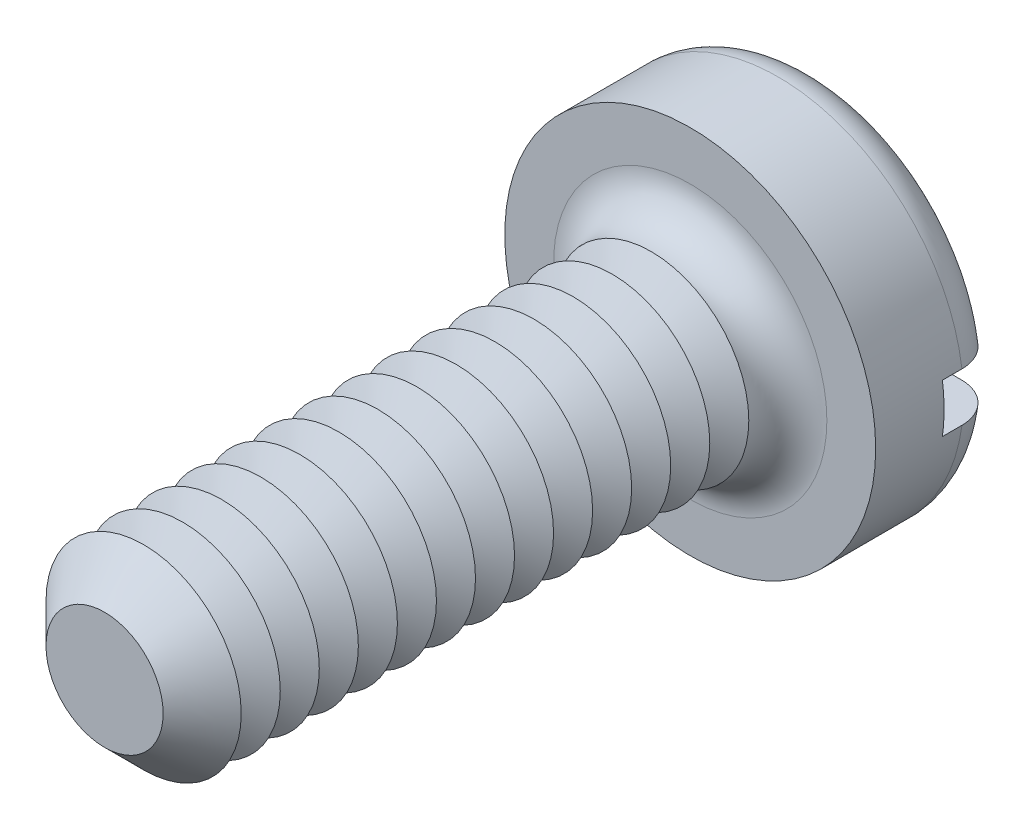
ISO-10303-21;
HEADER;
FILE_DESCRIPTION(('STEP AP214'),'2;1');
FILE_NAME('part.step','',(''),(''),'','','');
FILE_SCHEMA(('AUTOMOTIVE_DESIGN { 1 0 10303 214 1 1 1 1 }'));
ENDSEC;
DATA;
#1=APPLICATION_CONTEXT('core data for automotive mechanical design processes');
#2=APPLICATION_PROTOCOL_DEFINITION('international standard','automotive_design',2000,#1);
#3=PRODUCT_CONTEXT('',#1,'mechanical');
#4=PRODUCT('Part','Part','',(#3));
#5=PRODUCT_RELATED_PRODUCT_CATEGORY('part','',(#4));
#6=PRODUCT_DEFINITION_FORMATION('','',#4);
#7=PRODUCT_DEFINITION_CONTEXT('part definition',#1,'design');
#8=PRODUCT_DEFINITION('design','',#6,#7);
#9=PRODUCT_DEFINITION_SHAPE('','',#8);
#10=(LENGTH_UNIT() NAMED_UNIT(*) SI_UNIT(.MILLI.,.METRE.));
#11=(NAMED_UNIT(*) PLANE_ANGLE_UNIT() SI_UNIT($,.RADIAN.));
#12=(NAMED_UNIT(*) SI_UNIT($,.STERADIAN.) SOLID_ANGLE_UNIT());
#13=UNCERTAINTY_MEASURE_WITH_UNIT(LENGTH_MEASURE(1.E-05),#10,'distance_accuracy_value','');
#14=(GEOMETRIC_REPRESENTATION_CONTEXT(3) GLOBAL_UNCERTAINTY_ASSIGNED_CONTEXT((#13)) GLOBAL_UNIT_ASSIGNED_CONTEXT((#10,
#11,#12)) REPRESENTATION_CONTEXT('',''));
#15=CARTESIAN_POINT('',(0.,0.,0.));
#16=DIRECTION('',(0.,0.,1.));
#17=DIRECTION('',(1.,0.,0.));
#18=AXIS2_PLACEMENT_3D('',#15,#16,#17);
#19=CARTESIAN_POINT('',(0.,0.,-1.3));
#20=DIRECTION('',(0.,0.,1.));
#21=DIRECTION('',(1.,0.,0.));
#22=AXIS2_PLACEMENT_3D('',#19,#20,#21);
#23=PLANE('',#22);
#24=CARTESIAN_POINT('',(0.,0.,-1.3));
#25=DIRECTION('',(0.,0.,1.));
#26=DIRECTION('',(1.,0.,0.));
#27=AXIS2_PLACEMENT_3D('',#24,#25,#26);
#28=CIRCLE('',#27,1.5);
#29=CARTESIAN_POINT('',(-1.4790199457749,0.25,-1.3));
#30=VERTEX_POINT('',#29);
#31=CARTESIAN_POINT('',(1.4790199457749,0.25,-1.3));
#32=VERTEX_POINT('',#31);
#33=EDGE_CURVE('E116',#30,#32,#28,.F.);
#34=ORIENTED_EDGE('',*,*,#33,.T.);
#35=DIRECTION('',(1.,0.,0.));
#36=VECTOR('',#35,1.);
#37=CARTESIAN_POINT('',(-1.9,0.25,-1.3));
#38=LINE('',#37,#36);
#39=EDGE_CURVE('E111',#30,#32,#38,.T.);
#40=ORIENTED_EDGE('',*,*,#39,.F.);
#41=EDGE_LOOP('',(#34,#40));
#42=FACE_BOUND('',#41,.T.);
#43=ADVANCED_FACE('F39',(#42),#23,.F.);
#44=CARTESIAN_POINT('',(0.,0.,-0.9));
#45=DIRECTION('',(0.,0.,1.));
#46=DIRECTION('',(1.,0.,0.));
#47=AXIS2_PLACEMENT_3D('',#44,#45,#46);
#48=TOROIDAL_SURFACE('',#47,1.5,0.4);
#49=CARTESIAN_POINT('',(-1.8150392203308,0.25,-1.12284384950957));
#50=CARTESIAN_POINT('',(-1.80236980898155,0.25,-1.14155059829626));
#51=CARTESIAN_POINT('',(-1.78809920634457,0.25,-1.15919399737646));
#52=CARTESIAN_POINT('',(-1.75677844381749,0.25,-1.19184073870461));
#53=CARTESIAN_POINT('',(-1.73972468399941,0.25,-1.20684060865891));
#54=CARTESIAN_POINT('',(-1.70336024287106,0.25,-1.23375848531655));
#55=CARTESIAN_POINT('',(-1.68405164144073,0.25,-1.24567930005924));
#56=CARTESIAN_POINT('',(-1.64372549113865,0.25,-1.26613528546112));
#57=CARTESIAN_POINT('',(-1.6227083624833,0.25,-1.27467128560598));
#58=CARTESIAN_POINT('',(-1.57937988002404,0.25,-1.2881995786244));
#59=CARTESIAN_POINT('',(-1.55705957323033,0.25,-1.29316318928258));
#60=CARTESIAN_POINT('',(-1.51190394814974,0.25,-1.29931753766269));
#61=CARTESIAN_POINT('',(-1.48906857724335,0.25,-1.3005078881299));
#62=CARTESIAN_POINT('',(-1.4432641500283,0.25,-1.29909058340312));
#63=CARTESIAN_POINT('',(-1.42029638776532,0.25,-1.29644099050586));
#64=CARTESIAN_POINT('',(-1.37512297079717,0.25,-1.28735146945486));
#65=CARTESIAN_POINT('',(-1.3529173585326,0.25,-1.28091133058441));
#66=CARTESIAN_POINT('',(-1.30974098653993,0.25,-1.26436295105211));
#67=CARTESIAN_POINT('',(-1.28877978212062,0.25,-1.25422975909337));
#68=CARTESIAN_POINT('',(-1.24886205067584,0.25,-1.23057736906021));
#69=CARTESIAN_POINT('',(-1.22990554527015,0.25,-1.21705813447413));
#70=CARTESIAN_POINT('',(-1.19461911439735,0.25,-1.18704970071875));
#71=CARTESIAN_POINT('',(-1.17828051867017,0.25,-1.17057070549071));
#72=CARTESIAN_POINT('',(-1.14865897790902,0.25,-1.13506201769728));
#73=CARTESIAN_POINT('',(-1.13537576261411,0.25,-1.11603255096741));
#74=CARTESIAN_POINT('',(-1.11249827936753,0.25,-1.07630328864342));
#75=CARTESIAN_POINT('',(-1.10284494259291,0.25,-1.05563752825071));
#76=CARTESIAN_POINT('',(-1.08724024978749,0.25,-1.01295282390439));
#77=CARTESIAN_POINT('',(-1.08128829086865,0.25,-0.990934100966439));
#78=CARTESIAN_POINT('',(-1.07339124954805,0.25,-0.946722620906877));
#79=CARTESIAN_POINT('',(-1.07135558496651,0.25,-0.924546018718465));
#80=CARTESIAN_POINT('',(-1.07108722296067,0.25,-0.880170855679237));
#81=CARTESIAN_POINT('',(-1.07285419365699,0.25,-0.857972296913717));
#82=CARTESIAN_POINT('',(-1.0800838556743,0.25,-0.814463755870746));
#83=CARTESIAN_POINT('',(-1.08550159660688,0.25,-0.793146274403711));
#84=CARTESIAN_POINT('',(-1.09980522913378,0.25,-0.751709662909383));
#85=CARTESIAN_POINT('',(-1.10869126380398,0.25,-0.731590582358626));
#86=CARTESIAN_POINT('',(-1.12975121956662,0.25,-0.692901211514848));
#87=CARTESIAN_POINT('',(-1.14195627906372,0.25,-0.674347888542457));
#88=CARTESIAN_POINT('',(-1.1692428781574,0.25,-0.639494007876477));
#89=CARTESIAN_POINT('',(-1.18432473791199,0.25,-0.623193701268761));
#90=CARTESIAN_POINT('',(-1.21730350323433,0.25,-0.592916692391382));
#91=CARTESIAN_POINT('',(-1.23525650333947,0.25,-0.579001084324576));
#92=CARTESIAN_POINT('',(-1.27320799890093,0.25,-0.554314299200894));
#93=CARTESIAN_POINT('',(-1.2932067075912,0.25,-0.543543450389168));
#94=CARTESIAN_POINT('',(-1.33509120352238,0.25,-0.525253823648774));
#95=CARTESIAN_POINT('',(-1.35700545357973,0.25,-0.517800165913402));
#96=CARTESIAN_POINT('',(-1.401770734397,0.25,-0.506652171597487));
#97=CARTESIAN_POINT('',(-1.42462180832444,0.25,-0.502958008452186));
#98=CARTESIAN_POINT('',(-1.4707602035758,0.25,-0.499429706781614));
#99=CARTESIAN_POINT('',(-1.49404932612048,0.25,-0.499619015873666));
#100=CARTESIAN_POINT('',(-1.54026206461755,0.25,-0.50392615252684));
#101=CARTESIAN_POINT('',(-1.56318568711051,0.25,-0.508043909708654));
#102=CARTESIAN_POINT('',(-1.60788420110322,0.25,-0.520077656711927));
#103=CARTESIAN_POINT('',(-1.6296645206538,0.25,-0.527973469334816));
#104=CARTESIAN_POINT('',(-1.67156889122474,0.25,-0.547348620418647));
#105=CARTESIAN_POINT('',(-1.69169302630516,0.25,-0.558827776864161));
#106=CARTESIAN_POINT('',(-1.72948251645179,0.25,-0.584913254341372));
#107=CARTESIAN_POINT('',(-1.74717189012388,0.25,-0.599484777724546));
#108=CARTESIAN_POINT('',(-1.77981909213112,0.25,-0.63142070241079));
#109=CARTESIAN_POINT('',(-1.79477707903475,0.25,-0.648784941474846));
#110=CARTESIAN_POINT('',(-1.82136524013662,0.25,-0.685607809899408));
#111=CARTESIAN_POINT('',(-1.83303003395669,0.25,-0.705041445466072));
#112=CARTESIAN_POINT('',(-1.85289960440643,0.25,-0.745602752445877));
#113=CARTESIAN_POINT('',(-1.86110468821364,0.25,-0.76673027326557));
#114=CARTESIAN_POINT('',(-1.87375648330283,0.25,-0.809891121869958));
#115=CARTESIAN_POINT('',(-1.87823381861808,0.25,-0.831915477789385));
#116=CARTESIAN_POINT('',(-1.88341152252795,0.25,-0.87640983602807));
#117=CARTESIAN_POINT('',(-1.88411103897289,0.25,-0.898879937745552));
#118=CARTESIAN_POINT('',(-1.88171559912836,0.25,-0.943534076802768));
#119=CARTESIAN_POINT('',(-1.87863413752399,0.25,-0.965718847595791));
#120=CARTESIAN_POINT('',(-1.86879153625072,0.25,-1.00923650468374));
#121=CARTESIAN_POINT('',(-1.86203494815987,0.25,-1.03057040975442));
#122=CARTESIAN_POINT('',(-1.84837477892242,0.25,-1.06373797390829));
#123=CARTESIAN_POINT('',(-1.84255723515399,0.25,-1.07603047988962));
#124=CARTESIAN_POINT('',(-1.82969924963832,0.25,-1.09995814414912));
#125=CARTESIAN_POINT('',(-1.82265881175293,0.25,-1.11159330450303));
#126=CARTESIAN_POINT('',(-1.8150392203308,0.25,-1.12284384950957));
#127=B_SPLINE_CURVE_WITH_KNOTS('',3,(#49,#50,#51,#52,#53,#54,#55,#56,#57,#58,#59,#60,#61,#62,
#63,#64,#65,#66,#67,#68,#69,#70,#71,#72,#73,#74,#75,#76,#77,#78,#79,#80,#81,#82,#83,#84,#85,#86,
#87,#88,#89,#90,#91,#92,#93,#94,#95,#96,#97,#98,#99,#100,#101,#102,#103,#104,#105,#106,#107,
#108,#109,#110,#111,#112,#113,#114,#115,#116,#117,#118,#119,#120,#121,#122,#123,#124,#125,#126),
.UNSPECIFIED.,.T.,.F.,(4,2,2,2,2,2,2,2,2,2,2,2,2,2,2,2,2,2,2,2,2,2,2,2,2,2,2,2,2,2,2,2,2,2,2,2,
2,2,4),(0.,0.0677296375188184,0.135547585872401,0.203303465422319,0.27104273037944,
0.339319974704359,0.407604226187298,0.47663988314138,0.545679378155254,0.615194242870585,
0.684709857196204,0.753990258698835,0.82326452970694,0.891356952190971,0.959438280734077,
1.02592503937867,1.0924059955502,1.15808300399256,1.2237627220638,1.29008126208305,
1.35640718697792,1.4242376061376,1.49207510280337,1.5611911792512,1.63031044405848,
1.69984715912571,1.76938262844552,1.8385508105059,1.90771547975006,1.97613962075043,
2.04455978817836,2.11223135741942,2.17989691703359,2.24700094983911,2.31412011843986,
2.38100042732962,2.44779809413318,2.48853193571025,2.52926564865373),.UNSPECIFIED.);
#128=CARTESIAN_POINT('',(-1.88348082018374,0.25,-0.9));
#129=VERTEX_POINT('',#128);
#130=EDGE_CURVE('E283',#129,#30,#127,.T.);
#131=ORIENTED_EDGE('',*,*,#130,.F.);
#132=CARTESIAN_POINT('',(0.,0.,-0.9));
#133=DIRECTION('',(0.,0.,1.));
#134=DIRECTION('',(1.,0.,0.));
#135=AXIS2_PLACEMENT_3D('',#132,#133,#134);
#136=CIRCLE('',#135,1.9);
#137=CARTESIAN_POINT('',(1.88348082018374,0.25,-0.9));
#138=VERTEX_POINT('',#137);
#139=EDGE_CURVE('E125',#138,#129,#136,.T.);
#140=ORIENTED_EDGE('',*,*,#139,.F.);
#141=CARTESIAN_POINT('',(1.11362660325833,0.25,-1.07710243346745));
#142=CARTESIAN_POINT('',(1.12388366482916,0.25,-1.09736755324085));
#143=CARTESIAN_POINT('',(1.13589127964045,0.25,-1.11676768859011));
#144=CARTESIAN_POINT('',(1.16301945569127,0.25,-1.15328107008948));
#145=CARTESIAN_POINT('',(1.17814463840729,0.25,-1.17039085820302));
#146=CARTESIAN_POINT('',(1.21101661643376,0.25,-1.20182395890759));
#147=CARTESIAN_POINT('',(1.22875976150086,0.25,-1.21615108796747));
#148=CARTESIAN_POINT('',(1.26636392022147,0.25,-1.24166932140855));
#149=CARTESIAN_POINT('',(1.28622436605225,0.25,-1.25286126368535));
#150=CARTESIAN_POINT('',(1.32781377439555,0.25,-1.27196191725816));
#151=CARTESIAN_POINT('',(1.34956550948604,0.25,-1.27982107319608));
#152=CARTESIAN_POINT('',(1.39407620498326,0.25,-1.29180513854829));
#153=CARTESIAN_POINT('',(1.41683526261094,0.25,-1.29592968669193));
#154=CARTESIAN_POINT('',(1.46288034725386,0.25,-1.3003367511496));
#155=CARTESIAN_POINT('',(1.48616890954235,0.25,-1.30059287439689));
#156=CARTESIAN_POINT('',(1.53245605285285,0.25,-1.29717239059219));
#157=CARTESIAN_POINT('',(1.55545463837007,0.25,-1.29349584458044));
#158=CARTESIAN_POINT('',(1.60038828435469,0.25,-1.28232271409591));
#159=CARTESIAN_POINT('',(1.62232790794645,0.25,-1.27484449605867));
#160=CARTESIAN_POINT('',(1.66461970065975,0.25,-1.25627203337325));
#161=CARTESIAN_POINT('',(1.68497195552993,0.25,-1.24517798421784));
#162=CARTESIAN_POINT('',(1.72328060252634,0.25,-1.21981269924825));
#163=CARTESIAN_POINT('',(1.74126001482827,0.25,-1.2055762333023));
#164=CARTESIAN_POINT('',(1.77453973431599,0.25,-1.17425606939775));
#165=CARTESIAN_POINT('',(1.78984019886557,0.25,-1.1571725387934));
#166=CARTESIAN_POINT('',(1.81715014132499,0.25,-1.12084732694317));
#167=CARTESIAN_POINT('',(1.82919410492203,0.25,-1.10163156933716));
#168=CARTESIAN_POINT('',(1.84985315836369,0.25,-1.06143759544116));
#169=CARTESIAN_POINT('',(1.85846842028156,0.25,-1.04045946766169));
#170=CARTESIAN_POINT('',(1.87195437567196,0.25,-0.997526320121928));
#171=CARTESIAN_POINT('',(1.87685590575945,0.25,-0.975580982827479));
#172=CARTESIAN_POINT('',(1.88288741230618,0.25,-0.931178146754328));
#173=CARTESIAN_POINT('',(1.88401750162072,0.25,-0.908720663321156));
#174=CARTESIAN_POINT('',(1.88247598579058,0.25,-0.864033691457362));
#175=CARTESIAN_POINT('',(1.87982069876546,0.25,-0.841803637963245));
#176=CARTESIAN_POINT('',(1.87081646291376,0.25,-0.798104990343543));
#177=CARTESIAN_POINT('',(1.86446754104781,0.25,-0.776636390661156));
#178=CARTESIAN_POINT('',(1.84826063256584,0.25,-0.735060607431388));
#179=CARTESIAN_POINT('',(1.83840161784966,0.25,-0.714953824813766));
#180=CARTESIAN_POINT('',(1.81546327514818,0.25,-0.676670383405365));
#181=CARTESIAN_POINT('',(1.80238389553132,0.25,-0.658493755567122));
#182=CARTESIAN_POINT('',(1.77331327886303,0.25,-0.62448916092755));
#183=CARTESIAN_POINT('',(1.75730833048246,0.25,-0.608672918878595));
#184=CARTESIAN_POINT('',(1.72289038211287,0.25,-0.579924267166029));
#185=CARTESIAN_POINT('',(1.70447729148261,0.25,-0.566991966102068));
#186=CARTESIAN_POINT('',(1.66559643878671,0.25,-0.544254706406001));
#187=CARTESIAN_POINT('',(1.64511218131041,0.25,-0.53447796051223));
#188=CARTESIAN_POINT('',(1.60280554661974,0.25,-0.518459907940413));
#189=CARTESIAN_POINT('',(1.58098309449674,0.25,-0.512218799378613));
#190=CARTESIAN_POINT('',(1.53636184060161,0.25,-0.503375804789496));
#191=CARTESIAN_POINT('',(1.51355490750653,0.25,-0.500814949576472));
#192=CARTESIAN_POINT('',(1.46783245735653,0.25,-0.499516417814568));
#193=CARTESIAN_POINT('',(1.44491693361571,0.25,-0.500778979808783));
#194=CARTESIAN_POINT('',(1.39937748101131,0.25,-0.50711284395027));
#195=CARTESIAN_POINT('',(1.37675897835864,0.25,-0.512223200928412));
#196=CARTESIAN_POINT('',(1.33269286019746,0.25,-0.526151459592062));
#197=CARTESIAN_POINT('',(1.31124530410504,0.25,-0.534969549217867));
#198=CARTESIAN_POINT('',(1.27004097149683,0.25,-0.556118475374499));
#199=CARTESIAN_POINT('',(1.25029179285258,0.25,-0.568464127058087));
#200=CARTESIAN_POINT('',(1.21316554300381,0.25,-0.59631968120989));
#201=CARTESIAN_POINT('',(1.19578844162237,0.25,-0.611829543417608));
#202=CARTESIAN_POINT('',(1.16406059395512,0.25,-0.645459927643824));
#203=CARTESIAN_POINT('',(1.14968747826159,0.25,-0.663559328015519));
#204=CARTESIAN_POINT('',(1.12425968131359,0.25,-0.70195566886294));
#205=CARTESIAN_POINT('',(1.11320445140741,0.25,-0.722252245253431));
#206=CARTESIAN_POINT('',(1.09497726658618,0.25,-0.764020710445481));
#207=CARTESIAN_POINT('',(1.08772970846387,0.25,-0.785459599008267));
#208=CARTESIAN_POINT('',(1.07702618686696,0.25,-0.829269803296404));
#209=CARTESIAN_POINT('',(1.07357062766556,0.25,-0.851641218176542));
#210=CARTESIAN_POINT('',(1.07060826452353,0.25,-0.896160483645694));
#211=CARTESIAN_POINT('',(1.07101876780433,0.25,-0.918302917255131));
#212=CARTESIAN_POINT('',(1.07557730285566,0.25,-0.962179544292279));
#213=CARTESIAN_POINT('',(1.07972048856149,0.25,-0.983914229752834));
#214=CARTESIAN_POINT('',(1.08912066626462,0.25,-1.01754924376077));
#215=CARTESIAN_POINT('',(1.09320341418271,0.25,-1.02979035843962));
#216=CARTESIAN_POINT('',(1.10254493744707,0.25,-1.05381470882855));
#217=CARTESIAN_POINT('',(1.10780368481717,0.25,-1.06559795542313));
#218=CARTESIAN_POINT('',(1.11362660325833,0.25,-1.07710243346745));
#219=B_SPLINE_CURVE_WITH_KNOTS('',3,(#141,#142,#143,#144,#145,#146,#147,#148,#149,#150,#151,
#152,#153,#154,#155,#156,#157,#158,#159,#160,#161,#162,#163,#164,#165,#166,#167,#168,#169,#170,
#171,#172,#173,#174,#175,#176,#177,#178,#179,#180,#181,#182,#183,#184,#185,#186,#187,#188,#189,
#190,#191,#192,#193,#194,#195,#196,#197,#198,#199,#200,#201,#202,#203,#204,#205,#206,#207,#208,
#209,#210,#211,#212,#213,#214,#215,#216,#217,#218),.UNSPECIFIED.,.T.,.F.,(4,2,2,2,2,2,2,2,2,2,2,
2,2,2,2,2,2,2,2,2,2,2,2,2,2,2,2,2,2,2,2,2,2,2,2,2,2,2,4),(0.,0.0680907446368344,
0.136283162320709,0.204381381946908,0.272461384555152,0.341520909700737,0.410587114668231,
0.480124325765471,0.549660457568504,0.618863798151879,0.688063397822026,0.756532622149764,
0.824997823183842,0.892706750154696,0.960412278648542,1.02754926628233,1.09468424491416,
1.16153068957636,1.22837664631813,1.29524219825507,1.36210882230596,1.42929726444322,
1.49648823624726,1.56426429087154,1.63204414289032,1.70057395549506,1.76910804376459,
1.83834728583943,1.90759003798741,1.97712798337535,2.0466650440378,2.11566422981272,
2.18465199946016,2.25221259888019,2.3197804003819,2.38590630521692,2.45194648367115,
2.49060241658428,2.5292574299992),.UNSPECIFIED.);
#220=EDGE_CURVE('E285',#32,#138,#219,.T.);
#221=ORIENTED_EDGE('',*,*,#220,.F.);
#222=ORIENTED_EDGE('',*,*,#33,.F.);
#223=EDGE_LOOP('',(#131,#140,#221,#222));
#224=FACE_BOUND('',#223,.T.);
#225=ADVANCED_FACE('F267',(#224),#48,.T.);
#226=CARTESIAN_POINT('',(0.,0.,-1.3));
#227=DIRECTION('',(0.,0.,1.));
#228=DIRECTION('',(1.,0.,0.));
#229=AXIS2_PLACEMENT_3D('',#226,#227,#228);
#230=CYLINDRICAL_SURFACE('',#229,1.9);
#231=DIRECTION('',(0.,0.,1.));
#232=VECTOR('',#231,1.);
#233=CARTESIAN_POINT('',(1.88348082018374,0.25,-1.3));
#234=LINE('',#233,#232);
#235=CARTESIAN_POINT('',(1.88348082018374,0.25,-0.7));
#236=VERTEX_POINT('',#235);
#237=EDGE_CURVE('E300',#138,#236,#234,.T.);
#238=ORIENTED_EDGE('',*,*,#237,.F.);
#239=ORIENTED_EDGE('',*,*,#139,.T.);
#240=DIRECTION('',(0.,0.,1.));
#241=VECTOR('',#240,1.);
#242=CARTESIAN_POINT('',(-1.88348082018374,0.25,-1.3));
#243=LINE('',#242,#241);
#244=CARTESIAN_POINT('',(-1.88348082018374,0.25,-0.7));
#245=VERTEX_POINT('',#244);
#246=EDGE_CURVE('E63',#245,#129,#243,.F.);
#247=ORIENTED_EDGE('',*,*,#246,.F.);
#248=CARTESIAN_POINT('',(0.,0.,-0.7));
#249=DIRECTION('',(0.,0.,-1.));
#250=DIRECTION('',(-1.,0.,0.));
#251=AXIS2_PLACEMENT_3D('',#248,#249,#250);
#252=CIRCLE('',#251,1.9);
#253=CARTESIAN_POINT('',(-1.88348082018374,-0.25,-0.7));
#254=VERTEX_POINT('',#253);
#255=EDGE_CURVE('E43',#245,#254,#252,.F.);
#256=ORIENTED_EDGE('',*,*,#255,.T.);
#257=DIRECTION('',(0.,0.,1.));
#258=VECTOR('',#257,1.);
#259=CARTESIAN_POINT('',(-1.88348082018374,-0.25,-1.3));
#260=LINE('',#259,#258);
#261=CARTESIAN_POINT('',(-1.88348082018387,-0.25,-0.899999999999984));
#262=VERTEX_POINT('',#261);
#263=EDGE_CURVE('E297',#262,#254,#260,.T.);
#264=ORIENTED_EDGE('',*,*,#263,.F.);
#265=CARTESIAN_POINT('',(1.88348082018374,-0.25,-0.9));
#266=VERTEX_POINT('',#265);
#267=EDGE_CURVE('E127',#262,#266,#136,.T.);
#268=ORIENTED_EDGE('',*,*,#267,.T.);
#269=DIRECTION('',(0.,0.,1.));
#270=VECTOR('',#269,1.);
#271=CARTESIAN_POINT('',(1.88348082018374,-0.25,-1.3));
#272=LINE('',#271,#270);
#273=CARTESIAN_POINT('',(1.88348082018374,-0.25,-0.7));
#274=VERTEX_POINT('',#273);
#275=EDGE_CURVE('E55',#274,#266,#272,.F.);
#276=ORIENTED_EDGE('',*,*,#275,.F.);
#277=EDGE_CURVE('E11',#274,#236,#252,.F.);
#278=ORIENTED_EDGE('',*,*,#277,.T.);
#279=EDGE_LOOP('',(#238,#239,#247,#256,#264,#268,#276,#278));
#280=FACE_BOUND('',#279,.T.);
#281=CARTESIAN_POINT('',(0.,0.,0.));
#282=DIRECTION('',(0.,0.,1.));
#283=DIRECTION('',(1.,0.,0.));
#284=AXIS2_PLACEMENT_3D('',#281,#282,#283);
#285=CIRCLE('',#284,1.9);
#286=CARTESIAN_POINT('',(1.9,0.,0.));
#287=VERTEX_POINT('',#286);
#288=EDGE_CURVE('E303',#287,#287,#285,.T.);
#289=ORIENTED_EDGE('',*,*,#288,.F.);
#290=EDGE_LOOP('',(#289));
#291=FACE_BOUND('',#290,.T.);
#292=ADVANCED_FACE('F263',(#280,#291),#230,.T.);
#293=CARTESIAN_POINT('',(1.4790199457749,-0.25,-1.3));
#294=VERTEX_POINT('',#293);
#295=CARTESIAN_POINT('',(-1.4790199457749,-0.25,-1.3));
#296=VERTEX_POINT('',#295);
#297=EDGE_CURVE('E109',#294,#296,#28,.F.);
#298=ORIENTED_EDGE('',*,*,#297,.T.);
#299=DIRECTION('',(-1.,0.,0.));
#300=VECTOR('',#299,1.);
#301=CARTESIAN_POINT('',(-1.9,-0.25,-1.3));
#302=LINE('',#301,#300);
#303=EDGE_CURVE('E96',#294,#296,#302,.T.);
#304=ORIENTED_EDGE('',*,*,#303,.F.);
#305=EDGE_LOOP('',(#298,#304));
#306=FACE_BOUND('',#305,.T.);
#307=ADVANCED_FACE('F108',(#306),#23,.F.);
#308=CARTESIAN_POINT('',(0.,0.,0.));
#309=DIRECTION('',(0.,0.,1.));
#310=DIRECTION('',(1.,0.,0.));
#311=AXIS2_PLACEMENT_3D('',#308,#309,#310);
#312=PLANE('',#311);
#313=CARTESIAN_POINT('',(0.,0.,0.));
#314=DIRECTION('',(0.,0.,1.));
#315=DIRECTION('',(1.,0.,0.));
#316=AXIS2_PLACEMENT_3D('',#313,#314,#315);
#317=CIRCLE('',#316,1.4);
#318=CARTESIAN_POINT('',(1.4,0.,0.));
#319=VERTEX_POINT('',#318);
#320=EDGE_CURVE('E115',#319,#319,#317,.F.);
#321=ORIENTED_EDGE('',*,*,#320,.T.);
#322=EDGE_LOOP('',(#321));
#323=FACE_BOUND('',#322,.T.);
#324=ORIENTED_EDGE('',*,*,#288,.T.);
#325=EDGE_LOOP('',(#324));
#326=FACE_BOUND('',#325,.T.);
#327=ADVANCED_FACE('F262',(#323,#326),#312,.T.);
#328=CARTESIAN_POINT('',(-1.8150392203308,-0.25,-1.12284384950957));
#329=CARTESIAN_POINT('',(-1.82756185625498,-0.25,-1.10435021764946));
#330=CARTESIAN_POINT('',(-1.83853807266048,-0.25,-1.08479072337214));
#331=CARTESIAN_POINT('',(-1.85706233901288,-0.25,-1.04409188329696));
#332=CARTESIAN_POINT('',(-1.86460655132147,-0.25,-1.02295079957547));
#333=CARTESIAN_POINT('',(-1.87603074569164,-0.25,-0.979704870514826));
#334=CARTESIAN_POINT('',(-1.87991177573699,-0.25,-0.957600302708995));
#335=CARTESIAN_POINT('',(-1.88389586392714,-0.25,-0.913058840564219));
#336=CARTESIAN_POINT('',(-1.88399981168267,-0.25,-0.890622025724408));
#337=CARTESIAN_POINT('',(-1.88043374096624,-0.25,-0.846104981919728));
#338=CARTESIAN_POINT('',(-1.87677281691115,-0.25,-0.824024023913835));
#339=CARTESIAN_POINT('',(-1.86579880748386,-0.25,-0.780788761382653));
#340=CARTESIAN_POINT('',(-1.85848560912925,-0.25,-0.759634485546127));
#341=CARTESIAN_POINT('',(-1.8404137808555,-0.25,-0.718830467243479));
#342=CARTESIAN_POINT('',(-1.82965205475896,-0.25,-0.699182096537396));
#343=CARTESIAN_POINT('',(-1.80499939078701,-0.25,-0.661958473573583));
#344=CARTESIAN_POINT('',(-1.7911083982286,-0.25,-0.644383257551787));
#345=CARTESIAN_POINT('',(-1.76051564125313,-0.25,-0.611699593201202));
#346=CARTESIAN_POINT('',(-1.74379913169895,-0.25,-0.596604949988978));
#347=CARTESIAN_POINT('',(-1.70808901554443,-0.25,-0.569406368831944));
#348=CARTESIAN_POINT('',(-1.68909532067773,-0.25,-0.557302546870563));
#349=CARTESIAN_POINT('',(-1.64918615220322,-0.25,-0.536307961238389));
#350=CARTESIAN_POINT('',(-1.62825469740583,-0.25,-0.527447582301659));
#351=CARTESIAN_POINT('',(-1.58521203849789,-0.25,-0.513323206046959));
#352=CARTESIAN_POINT('',(-1.5631007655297,-0.25,-0.508059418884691));
#353=CARTESIAN_POINT('',(-1.51806209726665,-0.25,-0.501215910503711));
#354=CARTESIAN_POINT('',(-1.4951283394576,-0.25,-0.499678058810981));
#355=CARTESIAN_POINT('',(-1.4493239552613,-0.25,-0.500434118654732));
#356=CARTESIAN_POINT('',(-1.4264533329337,-0.25,-0.502728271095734));
#357=CARTESIAN_POINT('',(-1.38118643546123,-0.25,-0.511115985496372));
#358=CARTESIAN_POINT('',(-1.35879703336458,-0.25,-0.51724667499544));
#359=CARTESIAN_POINT('',(-1.31535851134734,-0.25,-0.533167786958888));
#360=CARTESIAN_POINT('',(-1.29430945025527,-0.25,-0.542958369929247));
#361=CARTESIAN_POINT('',(-1.25409242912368,-0.25,-0.565968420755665));
#362=CARTESIAN_POINT('',(-1.23493023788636,-0.25,-0.579197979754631));
#363=CARTESIAN_POINT('',(-1.19912477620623,-0.25,-0.608715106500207));
#364=CARTESIAN_POINT('',(-1.18248143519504,-0.25,-0.625002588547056));
#365=CARTESIAN_POINT('',(-1.15237533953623,-0.25,-0.660018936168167));
#366=CARTESIAN_POINT('',(-1.13888343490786,-0.25,-0.678722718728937));
#367=CARTESIAN_POINT('',(-1.115312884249,-0.25,-0.718170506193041));
#368=CARTESIAN_POINT('',(-1.10523377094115,-0.25,-0.738914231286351));
#369=CARTESIAN_POINT('',(-1.08901310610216,-0.25,-0.781372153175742));
#370=CARTESIAN_POINT('',(-1.08279080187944,-0.25,-0.803055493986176));
#371=CARTESIAN_POINT('',(-1.07416105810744,-0.25,-0.847167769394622));
#372=CARTESIAN_POINT('',(-1.07175306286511,-0.25,-0.869596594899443));
#373=CARTESIAN_POINT('',(-1.07084656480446,-0.25,-0.914070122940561));
#374=CARTESIAN_POINT('',(-1.07226874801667,-0.25,-0.936113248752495));
#375=CARTESIAN_POINT('',(-1.07880428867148,-0.25,-0.979644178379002));
#376=CARTESIAN_POINT('',(-1.08391755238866,-0.25,-1.00113199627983));
#377=CARTESIAN_POINT('',(-1.09764616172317,-0.25,-1.04290115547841));
#378=CARTESIAN_POINT('',(-1.10625346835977,-0.25,-1.06318514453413));
#379=CARTESIAN_POINT('',(-1.12669365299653,-0.25,-1.10205584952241));
#380=CARTESIAN_POINT('',(-1.13852679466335,-0.25,-1.12064242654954));
#381=CARTESIAN_POINT('',(-1.16529672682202,-0.25,-1.15594801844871));
#382=CARTESIAN_POINT('',(-1.18028464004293,-0.25,-1.17262825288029));
#383=CARTESIAN_POINT('',(-1.21279183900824,-0.25,-1.20330600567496));
#384=CARTESIAN_POINT('',(-1.23031142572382,-0.25,-1.21730320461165));
#385=CARTESIAN_POINT('',(-1.26781695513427,-0.25,-1.24254670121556));
#386=CARTESIAN_POINT('',(-1.28784999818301,-0.25,-1.25372305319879));
#387=CARTESIAN_POINT('',(-1.3294899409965,-0.25,-1.27260611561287));
#388=CARTESIAN_POINT('',(-1.35109697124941,-0.25,-1.28031253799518));
#389=CARTESIAN_POINT('',(-1.39558575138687,-0.25,-1.29212626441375));
#390=CARTESIAN_POINT('',(-1.4184807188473,-0.25,-1.29618386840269));
#391=CARTESIAN_POINT('',(-1.4646266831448,-0.25,-1.30039947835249));
#392=CARTESIAN_POINT('',(-1.48787767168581,-0.25,-1.30055757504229));
#393=CARTESIAN_POINT('',(-1.53407883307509,-0.25,-1.29695468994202));
#394=CARTESIAN_POINT('',(-1.55702895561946,-0.25,-1.29319306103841));
#395=CARTESIAN_POINT('',(-1.60196718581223,-0.25,-1.28183520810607));
#396=CARTESIAN_POINT('',(-1.62395508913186,-0.25,-1.27423817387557));
#397=CARTESIAN_POINT('',(-1.66614393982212,-0.25,-1.25548646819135));
#398=CARTESIAN_POINT('',(-1.68635782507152,-0.25,-1.24436087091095));
#399=CARTESIAN_POINT('',(-1.72458266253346,-0.25,-1.21884344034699));
#400=CARTESIAN_POINT('',(-1.74259637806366,-0.25,-1.20445577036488));
#401=CARTESIAN_POINT('',(-1.76968989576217,-0.25,-1.1787247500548));
#402=CARTESIAN_POINT('',(-1.77959984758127,-0.25,-1.1682407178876));
#403=CARTESIAN_POINT('',(-1.79823423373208,-0.25,-1.14626700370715));
#404=CARTESIAN_POINT('',(-1.80695867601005,-0.25,-1.1347773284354));
#405=CARTESIAN_POINT('',(-1.8150392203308,-0.25,-1.12284384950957));
#406=B_SPLINE_CURVE_WITH_KNOTS('',3,(#328,#329,#330,#331,#332,#333,#334,#335,#336,#337,#338,
#339,#340,#341,#342,#343,#344,#345,#346,#347,#348,#349,#350,#351,#352,#353,#354,#355,#356,#357,
#358,#359,#360,#361,#362,#363,#364,#365,#366,#367,#368,#369,#370,#371,#372,#373,#374,#375,#376,
#377,#378,#379,#380,#381,#382,#383,#384,#385,#386,#387,#388,#389,#390,#391,#392,#393,#394,#395,
#396,#397,#398,#399,#400,#401,#402,#403,#404,#405),.UNSPECIFIED.,.T.,.F.,(4,2,2,2,2,2,2,2,2,2,2,
2,2,2,2,2,2,2,2,2,2,2,2,2,2,2,2,2,2,2,2,2,2,2,2,2,2,2,4),(0.,0.0669512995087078,
0.133977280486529,0.200984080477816,0.267975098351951,0.334804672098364,0.401636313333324,
0.468528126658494,0.535421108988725,0.602674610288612,0.669930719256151,0.737801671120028,
0.805676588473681,0.87431077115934,0.942949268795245,1.0122625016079,1.08157877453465,
1.15110078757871,1.22062085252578,1.28946987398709,1.35830946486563,1.42565417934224,
1.49298908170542,1.55894041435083,1.62489007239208,1.69068884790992,1.75649300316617,
1.82345932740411,1.89043361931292,1.95893391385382,2.02743989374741,2.09686543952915,
2.16628937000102,2.23572476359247,2.3051748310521,2.3740669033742,2.44287154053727,
2.48607383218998,2.52927583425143),.UNSPECIFIED.);
#407=EDGE_CURVE('E103',#296,#262,#406,.T.);
#408=ORIENTED_EDGE('',*,*,#407,.F.);
#409=ORIENTED_EDGE('',*,*,#297,.F.);
#410=CARTESIAN_POINT('',(1.11362660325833,-0.25,-1.07710243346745));
#411=CARTESIAN_POINT('',(1.10368387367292,-0.25,-1.05745397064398));
#412=CARTESIAN_POINT('',(1.09537204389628,-0.25,-1.0369644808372));
#413=CARTESIAN_POINT('',(1.08229212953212,-0.25,-0.994867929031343));
#414=CARTESIAN_POINT('',(1.07752732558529,-0.25,-0.973259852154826));
#415=CARTESIAN_POINT('',(1.07171197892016,-0.25,-0.929545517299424));
#416=CARTESIAN_POINT('',(1.07066166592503,-0.25,-0.907439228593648));
#417=CARTESIAN_POINT('',(1.07231382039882,-0.25,-0.863372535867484));
#418=CARTESIAN_POINT('',(1.07501551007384,-0.25,-0.841412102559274));
#419=CARTESIAN_POINT('',(1.08404966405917,-0.25,-0.798386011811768));
#420=CARTESIAN_POINT('',(1.09036099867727,-0.25,-0.777315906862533));
#421=CARTESIAN_POINT('',(1.10638973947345,-0.25,-0.736514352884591));
#422=CARTESIAN_POINT('',(1.11610743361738,-0.25,-0.716783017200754));
#423=CARTESIAN_POINT('',(1.13878208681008,-0.25,-0.678952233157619));
#424=CARTESIAN_POINT('',(1.15177705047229,-0.25,-0.660875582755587));
#425=CARTESIAN_POINT('',(1.18055347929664,-0.25,-0.62709692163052));
#426=CARTESIAN_POINT('',(1.19633525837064,-0.25,-0.611395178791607));
#427=CARTESIAN_POINT('',(1.23062926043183,-0.25,-0.582430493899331));
#428=CARTESIAN_POINT('',(1.24919608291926,-0.25,-0.569232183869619));
#429=CARTESIAN_POINT('',(1.28825118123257,-0.25,-0.546076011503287));
#430=CARTESIAN_POINT('',(1.30873964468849,-0.25,-0.536118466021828));
#431=CARTESIAN_POINT('',(1.35144534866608,-0.25,-0.519560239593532));
#432=CARTESIAN_POINT('',(1.3736865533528,-0.25,-0.513021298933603));
#433=CARTESIAN_POINT('',(1.41894945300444,-0.25,-0.503751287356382));
#434=CARTESIAN_POINT('',(1.44197117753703,-0.25,-0.50102036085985));
#435=CARTESIAN_POINT('',(1.48824913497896,-0.25,-0.499449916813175));
#436=CARTESIAN_POINT('',(1.5115059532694,-0.25,-0.500627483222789));
#437=CARTESIAN_POINT('',(1.55748678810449,-0.25,-0.506895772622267));
#438=CARTESIAN_POINT('',(1.58021081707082,-0.25,-0.511986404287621));
#439=CARTESIAN_POINT('',(1.6243247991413,-0.25,-0.525910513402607));
#440=CARTESIAN_POINT('',(1.64572225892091,-0.25,-0.534720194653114));
#441=CARTESIAN_POINT('',(1.68671060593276,-0.25,-0.555845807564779));
#442=CARTESIAN_POINT('',(1.70630159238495,-0.25,-0.568161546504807));
#443=CARTESIAN_POINT('',(1.74289060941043,-0.25,-0.595805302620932));
#444=CARTESIAN_POINT('',(1.75991474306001,-0.25,-0.611098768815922));
#445=CARTESIAN_POINT('',(1.79111916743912,-0.25,-0.644354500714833));
#446=CARTESIAN_POINT('',(1.80529962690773,-0.25,-0.662316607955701));
#447=CARTESIAN_POINT('',(1.83025525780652,-0.25,-0.700191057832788));
#448=CARTESIAN_POINT('',(1.84106535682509,-0.25,-0.720080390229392));
#449=CARTESIAN_POINT('',(1.8591630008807,-0.25,-0.761401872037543));
#450=CARTESIAN_POINT('',(1.86645070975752,-0.25,-0.782833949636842));
#451=CARTESIAN_POINT('',(1.87724305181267,-0.25,-0.826454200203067));
#452=CARTESIAN_POINT('',(1.88077646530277,-0.25,-0.848635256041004));
#453=CARTESIAN_POINT('',(1.88405487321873,-0.25,-0.89327539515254));
#454=CARTESIAN_POINT('',(1.88379996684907,-0.25,-0.915734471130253));
#455=CARTESIAN_POINT('',(1.87951702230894,-0.25,-0.96021054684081));
#456=CARTESIAN_POINT('',(1.87550211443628,-0.25,-0.982228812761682));
#457=CARTESIAN_POINT('',(1.86383665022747,-0.25,-1.0252797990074));
#458=CARTESIAN_POINT('',(1.85618610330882,-0.25,-1.04631252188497));
#459=CARTESIAN_POINT('',(1.83746332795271,-0.25,-1.08682395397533));
#460=CARTESIAN_POINT('',(1.82638722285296,-0.25,-1.10630087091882));
#461=CARTESIAN_POINT('',(1.80113946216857,-0.25,-1.14313202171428));
#462=CARTESIAN_POINT('',(1.78696774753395,-0.25,-1.1604862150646));
#463=CARTESIAN_POINT('',(1.75585044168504,-0.25,-1.19268694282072));
#464=CARTESIAN_POINT('',(1.73888979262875,-0.25,-1.20751892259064));
#465=CARTESIAN_POINT('',(1.7027387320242,-0.25,-1.23415579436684));
#466=CARTESIAN_POINT('',(1.68354822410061,-0.25,-1.24596055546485));
#467=CARTESIAN_POINT('',(1.64329341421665,-0.25,-1.26632784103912));
#468=CARTESIAN_POINT('',(1.62221336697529,-0.25,-1.27485924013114));
#469=CARTESIAN_POINT('',(1.5789301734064,-0.25,-1.28830571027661));
#470=CARTESIAN_POINT('',(1.55672695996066,-0.25,-1.29322056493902));
#471=CARTESIAN_POINT('',(1.5115614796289,-0.25,-1.29935191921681));
#472=CARTESIAN_POINT('',(1.4885934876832,-0.25,-1.30052625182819));
#473=CARTESIAN_POINT('',(1.44278240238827,-0.25,-1.2990417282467));
#474=CARTESIAN_POINT('',(1.41993931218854,-0.25,-1.29638277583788));
#475=CARTESIAN_POINT('',(1.37479511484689,-0.25,-1.28727159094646));
#476=CARTESIAN_POINT('',(1.35250125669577,-0.25,-1.2807834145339));
#477=CARTESIAN_POINT('',(1.30930729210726,-0.25,-1.2641644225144));
#478=CARTESIAN_POINT('',(1.2884075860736,-0.25,-1.25403256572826));
#479=CARTESIAN_POINT('',(1.24854853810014,-0.25,-1.23036781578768));
#480=CARTESIAN_POINT('',(1.22959511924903,-0.25,-1.21682495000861));
#481=CARTESIAN_POINT('',(1.19427766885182,-0.25,-1.18672803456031));
#482=CARTESIAN_POINT('',(1.17791048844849,-0.25,-1.170177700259));
#483=CARTESIAN_POINT('',(1.15346856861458,-0.25,-1.14079355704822));
#484=CARTESIAN_POINT('',(1.14449891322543,-0.25,-1.12869247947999));
#485=CARTESIAN_POINT('',(1.12797460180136,-0.25,-1.10355927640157));
#486=CARTESIAN_POINT('',(1.1204199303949,-0.25,-1.09052716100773));
#487=CARTESIAN_POINT('',(1.11362660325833,-0.25,-1.07710243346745));
#488=B_SPLINE_CURVE_WITH_KNOTS('',3,(#410,#411,#412,#413,#414,#415,#416,#417,#418,#419,#420,
#421,#422,#423,#424,#425,#426,#427,#428,#429,#430,#431,#432,#433,#434,#435,#436,#437,#438,#439,
#440,#441,#442,#443,#444,#445,#446,#447,#448,#449,#450,#451,#452,#453,#454,#455,#456,#457,#458,
#459,#460,#461,#462,#463,#464,#465,#466,#467,#468,#469,#470,#471,#472,#473,#474,#475,#476,#477,
#478,#479,#480,#481,#482,#483,#484,#485,#486,#487),.UNSPECIFIED.,.T.,.F.,(4,2,2,2,2,2,2,2,2,2,2,
2,2,2,2,2,2,2,2,2,2,2,2,2,2,2,2,2,2,2,2,2,2,2,2,2,2,2,4),(0.,0.0660089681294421,
0.132078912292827,0.198152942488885,0.26421327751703,0.329890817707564,0.395573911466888,
0.462056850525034,0.528547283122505,0.596571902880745,0.664603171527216,0.733823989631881,
0.803047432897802,0.872573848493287,0.94209864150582,1.01118516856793,1.08026789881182,
1.14859228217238,1.21691261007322,1.28449938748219,1.35208302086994,1.41914473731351,
1.48620469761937,1.55303134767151,1.61985782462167,1.68676020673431,1.75366386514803,
1.82094137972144,1.88822180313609,1.95612699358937,2.0240362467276,2.09270838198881,
2.16138224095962,2.23071121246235,2.30006001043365,2.36961396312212,2.4390825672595,
2.48418340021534,2.52928374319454),.UNSPECIFIED.);
#489=EDGE_CURVE('E92',#266,#294,#488,.T.);
#490=ORIENTED_EDGE('',*,*,#489,.F.);
#491=ORIENTED_EDGE('',*,*,#267,.F.);
#492=EDGE_LOOP('',(#408,#409,#490,#491));
#493=FACE_BOUND('',#492,.T.);
#494=ADVANCED_FACE('F113',(#493),#48,.T.);
#495=CARTESIAN_POINT('',(0.,0.,0.4));
#496=DIRECTION('',(0.,0.,1.));
#497=DIRECTION('',(1.,0.,0.));
#498=AXIS2_PLACEMENT_3D('',#495,#496,#497);
#499=TOROIDAL_SURFACE('',#498,1.4,0.4);
#500=ORIENTED_EDGE('',*,*,#320,.F.);
#501=EDGE_LOOP('',(#500));
#502=FACE_BOUND('',#501,.T.);
#503=CARTESIAN_POINT('',(0.,0.,0.4));
#504=DIRECTION('',(0.,0.,-1.));
#505=DIRECTION('',(-1.,0.,0.));
#506=AXIS2_PLACEMENT_3D('',#503,#504,#505);
#507=CIRCLE('',#506,1.);
#508=CARTESIAN_POINT('',(-1.,0.,0.4));
#509=VERTEX_POINT('',#508);
#510=EDGE_CURVE('E309',#509,#509,#507,.T.);
#511=ORIENTED_EDGE('',*,*,#510,.T.);
#512=EDGE_LOOP('',(#511));
#513=FACE_BOUND('',#512,.T.);
#514=ADVANCED_FACE('F255',(#502,#513),#499,.F.);
#515=CARTESIAN_POINT('',(0.,0.,0.6));
#516=DIRECTION('',(0.,0.,-1.));
#517=DIRECTION('',(-1.,0.,0.));
#518=AXIS2_PLACEMENT_3D('',#515,#516,#517);
#519=CONICAL_SURFACE('',#518,0.653589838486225,1.0471975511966);
#520=ORIENTED_EDGE('',*,*,#510,.F.);
#521=EDGE_LOOP('',(#520));
#522=FACE_BOUND('',#521,.T.);
#523=CARTESIAN_POINT('',(0.,0.,0.6));
#524=DIRECTION('',(0.,0.,-1.));
#525=DIRECTION('',(-1.,0.,0.));
#526=AXIS2_PLACEMENT_3D('',#523,#524,#525);
#527=CIRCLE('',#526,0.653589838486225);
#528=CARTESIAN_POINT('',(-0.653589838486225,0.,0.6));
#529=VERTEX_POINT('',#528);
#530=EDGE_CURVE('E315',#529,#529,#527,.T.);
#531=ORIENTED_EDGE('',*,*,#530,.T.);
#532=EDGE_LOOP('',(#531));
#533=FACE_BOUND('',#532,.T.);
#534=ADVANCED_FACE('F251',(#522,#533),#519,.T.);
#535=CARTESIAN_POINT('',(0.,0.,0.8));
#536=DIRECTION('',(0.,0.,1.));
#537=DIRECTION('',(1.,0.,0.));
#538=AXIS2_PLACEMENT_3D('',#535,#536,#537);
#539=CONICAL_SURFACE('',#538,1.,1.0471975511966);
#540=ORIENTED_EDGE('',*,*,#530,.F.);
#541=EDGE_LOOP('',(#540));
#542=FACE_BOUND('',#541,.T.);
#543=CARTESIAN_POINT('',(0.,0.,0.8));
#544=DIRECTION('',(0.,0.,-1.));
#545=DIRECTION('',(-1.,0.,0.));
#546=AXIS2_PLACEMENT_3D('',#543,#544,#545);
#547=CIRCLE('',#546,1.);
#548=CARTESIAN_POINT('',(-1.,0.,0.8));
#549=VERTEX_POINT('',#548);
#550=EDGE_CURVE('E321',#549,#549,#547,.T.);
#551=ORIENTED_EDGE('',*,*,#550,.T.);
#552=EDGE_LOOP('',(#551));
#553=FACE_BOUND('',#552,.T.);
#554=ADVANCED_FACE('F247',(#542,#553),#539,.T.);
#555=CARTESIAN_POINT('',(0.,0.,1.));
#556=DIRECTION('',(0.,0.,-1.));
#557=DIRECTION('',(-1.,0.,0.));
#558=AXIS2_PLACEMENT_3D('',#555,#556,#557);
#559=CONICAL_SURFACE('',#558,0.653589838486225,1.0471975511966);
#560=ORIENTED_EDGE('',*,*,#550,.F.);
#561=EDGE_LOOP('',(#560));
#562=FACE_BOUND('',#561,.T.);
#563=CARTESIAN_POINT('',(0.,0.,1.));
#564=DIRECTION('',(0.,0.,-1.));
#565=DIRECTION('',(-1.,0.,0.));
#566=AXIS2_PLACEMENT_3D('',#563,#564,#565);
#567=CIRCLE('',#566,0.653589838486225);
#568=CARTESIAN_POINT('',(-0.653589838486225,0.,1.));
#569=VERTEX_POINT('',#568);
#570=EDGE_CURVE('E324',#569,#569,#567,.T.);
#571=ORIENTED_EDGE('',*,*,#570,.T.);
#572=EDGE_LOOP('',(#571));
#573=FACE_BOUND('',#572,.T.);
#574=ADVANCED_FACE('F243',(#562,#573),#559,.T.);
#575=CARTESIAN_POINT('',(0.,0.,1.2));
#576=DIRECTION('',(0.,0.,1.));
#577=DIRECTION('',(1.,0.,0.));
#578=AXIS2_PLACEMENT_3D('',#575,#576,#577);
#579=CONICAL_SURFACE('',#578,1.,1.0471975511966);
#580=ORIENTED_EDGE('',*,*,#570,.F.);
#581=EDGE_LOOP('',(#580));
#582=FACE_BOUND('',#581,.T.);
#583=CARTESIAN_POINT('',(0.,0.,1.2));
#584=DIRECTION('',(0.,0.,-1.));
#585=DIRECTION('',(-1.,0.,0.));
#586=AXIS2_PLACEMENT_3D('',#583,#584,#585);
#587=CIRCLE('',#586,1.);
#588=CARTESIAN_POINT('',(-1.,0.,1.2));
#589=VERTEX_POINT('',#588);
#590=EDGE_CURVE('E327',#589,#589,#587,.T.);
#591=ORIENTED_EDGE('',*,*,#590,.T.);
#592=EDGE_LOOP('',(#591));
#593=FACE_BOUND('',#592,.T.);
#594=ADVANCED_FACE('F239',(#582,#593),#579,.T.);
#595=CARTESIAN_POINT('',(0.,0.,1.4));
#596=DIRECTION('',(0.,0.,-1.));
#597=DIRECTION('',(-1.,0.,0.));
#598=AXIS2_PLACEMENT_3D('',#595,#596,#597);
#599=CONICAL_SURFACE('',#598,0.653589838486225,1.0471975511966);
#600=ORIENTED_EDGE('',*,*,#590,.F.);
#601=EDGE_LOOP('',(#600));
#602=FACE_BOUND('',#601,.T.);
#603=CARTESIAN_POINT('',(0.,0.,1.4));
#604=DIRECTION('',(0.,0.,-1.));
#605=DIRECTION('',(-1.,0.,0.));
#606=AXIS2_PLACEMENT_3D('',#603,#604,#605);
#607=CIRCLE('',#606,0.653589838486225);
#608=CARTESIAN_POINT('',(-0.653589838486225,0.,1.4));
#609=VERTEX_POINT('',#608);
#610=EDGE_CURVE('E331',#609,#609,#607,.T.);
#611=ORIENTED_EDGE('',*,*,#610,.T.);
#612=EDGE_LOOP('',(#611));
#613=FACE_BOUND('',#612,.T.);
#614=ADVANCED_FACE('F235',(#602,#613),#599,.T.);
#615=CARTESIAN_POINT('',(0.,0.,1.6));
#616=DIRECTION('',(0.,0.,1.));
#617=DIRECTION('',(1.,0.,0.));
#618=AXIS2_PLACEMENT_3D('',#615,#616,#617);
#619=CONICAL_SURFACE('',#618,1.,1.0471975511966);
#620=ORIENTED_EDGE('',*,*,#610,.F.);
#621=EDGE_LOOP('',(#620));
#622=FACE_BOUND('',#621,.T.);
#623=CARTESIAN_POINT('',(0.,0.,1.6));
#624=DIRECTION('',(0.,0.,-1.));
#625=DIRECTION('',(-1.,0.,0.));
#626=AXIS2_PLACEMENT_3D('',#623,#624,#625);
#627=CIRCLE('',#626,1.);
#628=CARTESIAN_POINT('',(-1.,0.,1.6));
#629=VERTEX_POINT('',#628);
#630=EDGE_CURVE('E335',#629,#629,#627,.T.);
#631=ORIENTED_EDGE('',*,*,#630,.T.);
#632=EDGE_LOOP('',(#631));
#633=FACE_BOUND('',#632,.T.);
#634=ADVANCED_FACE('F231',(#622,#633),#619,.T.);
#635=CARTESIAN_POINT('',(0.,0.,1.8));
#636=DIRECTION('',(0.,0.,-1.));
#637=DIRECTION('',(-1.,0.,0.));
#638=AXIS2_PLACEMENT_3D('',#635,#636,#637);
#639=CONICAL_SURFACE('',#638,0.653589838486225,1.0471975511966);
#640=ORIENTED_EDGE('',*,*,#630,.F.);
#641=EDGE_LOOP('',(#640));
#642=FACE_BOUND('',#641,.T.);
#643=CARTESIAN_POINT('',(0.,0.,1.8));
#644=DIRECTION('',(0.,0.,-1.));
#645=DIRECTION('',(-1.,0.,0.));
#646=AXIS2_PLACEMENT_3D('',#643,#644,#645);
#647=CIRCLE('',#646,0.653589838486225);
#648=CARTESIAN_POINT('',(-0.653589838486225,0.,1.8));
#649=VERTEX_POINT('',#648);
#650=EDGE_CURVE('E339',#649,#649,#647,.T.);
#651=ORIENTED_EDGE('',*,*,#650,.T.);
#652=EDGE_LOOP('',(#651));
#653=FACE_BOUND('',#652,.T.);
#654=ADVANCED_FACE('F227',(#642,#653),#639,.T.);
#655=CARTESIAN_POINT('',(0.,0.,2.));
#656=DIRECTION('',(0.,0.,1.));
#657=DIRECTION('',(1.,0.,0.));
#658=AXIS2_PLACEMENT_3D('',#655,#656,#657);
#659=CONICAL_SURFACE('',#658,1.,1.0471975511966);
#660=ORIENTED_EDGE('',*,*,#650,.F.);
#661=EDGE_LOOP('',(#660));
#662=FACE_BOUND('',#661,.T.);
#663=CARTESIAN_POINT('',(0.,0.,2.));
#664=DIRECTION('',(0.,0.,-1.));
#665=DIRECTION('',(-1.,0.,0.));
#666=AXIS2_PLACEMENT_3D('',#663,#664,#665);
#667=CIRCLE('',#666,1.);
#668=CARTESIAN_POINT('',(-1.,0.,2.));
#669=VERTEX_POINT('',#668);
#670=EDGE_CURVE('E343',#669,#669,#667,.T.);
#671=ORIENTED_EDGE('',*,*,#670,.T.);
#672=EDGE_LOOP('',(#671));
#673=FACE_BOUND('',#672,.T.);
#674=ADVANCED_FACE('F223',(#662,#673),#659,.T.);
#675=CARTESIAN_POINT('',(0.,0.,2.2));
#676=DIRECTION('',(0.,0.,-1.));
#677=DIRECTION('',(-1.,0.,0.));
#678=AXIS2_PLACEMENT_3D('',#675,#676,#677);
#679=CONICAL_SURFACE('',#678,0.653589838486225,1.0471975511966);
#680=ORIENTED_EDGE('',*,*,#670,.F.);
#681=EDGE_LOOP('',(#680));
#682=FACE_BOUND('',#681,.T.);
#683=CARTESIAN_POINT('',(0.,0.,2.2));
#684=DIRECTION('',(0.,0.,-1.));
#685=DIRECTION('',(-1.,0.,0.));
#686=AXIS2_PLACEMENT_3D('',#683,#684,#685);
#687=CIRCLE('',#686,0.653589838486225);
#688=CARTESIAN_POINT('',(-0.653589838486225,0.,2.2));
#689=VERTEX_POINT('',#688);
#690=EDGE_CURVE('E347',#689,#689,#687,.T.);
#691=ORIENTED_EDGE('',*,*,#690,.T.);
#692=EDGE_LOOP('',(#691));
#693=FACE_BOUND('',#692,.T.);
#694=ADVANCED_FACE('F219',(#682,#693),#679,.T.);
#695=CARTESIAN_POINT('',(0.,0.,2.4));
#696=DIRECTION('',(0.,0.,1.));
#697=DIRECTION('',(1.,0.,0.));
#698=AXIS2_PLACEMENT_3D('',#695,#696,#697);
#699=CONICAL_SURFACE('',#698,1.,1.0471975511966);
#700=ORIENTED_EDGE('',*,*,#690,.F.);
#701=EDGE_LOOP('',(#700));
#702=FACE_BOUND('',#701,.T.);
#703=CARTESIAN_POINT('',(0.,0.,2.4));
#704=DIRECTION('',(0.,0.,-1.));
#705=DIRECTION('',(-1.,0.,0.));
#706=AXIS2_PLACEMENT_3D('',#703,#704,#705);
#707=CIRCLE('',#706,1.);
#708=CARTESIAN_POINT('',(-1.,0.,2.4));
#709=VERTEX_POINT('',#708);
#710=EDGE_CURVE('E350',#709,#709,#707,.T.);
#711=ORIENTED_EDGE('',*,*,#710,.T.);
#712=EDGE_LOOP('',(#711));
#713=FACE_BOUND('',#712,.T.);
#714=ADVANCED_FACE('F215',(#702,#713),#699,.T.);
#715=CARTESIAN_POINT('',(0.,0.,2.6));
#716=DIRECTION('',(0.,0.,-1.));
#717=DIRECTION('',(-1.,0.,0.));
#718=AXIS2_PLACEMENT_3D('',#715,#716,#717);
#719=CONICAL_SURFACE('',#718,0.653589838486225,1.0471975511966);
#720=ORIENTED_EDGE('',*,*,#710,.F.);
#721=EDGE_LOOP('',(#720));
#722=FACE_BOUND('',#721,.T.);
#723=CARTESIAN_POINT('',(0.,0.,2.6));
#724=DIRECTION('',(0.,0.,-1.));
#725=DIRECTION('',(-1.,0.,0.));
#726=AXIS2_PLACEMENT_3D('',#723,#724,#725);
#727=CIRCLE('',#726,0.653589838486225);
#728=CARTESIAN_POINT('',(-0.653589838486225,0.,2.6));
#729=VERTEX_POINT('',#728);
#730=EDGE_CURVE('E354',#729,#729,#727,.T.);
#731=ORIENTED_EDGE('',*,*,#730,.T.);
#732=EDGE_LOOP('',(#731));
#733=FACE_BOUND('',#732,.T.);
#734=ADVANCED_FACE('F211',(#722,#733),#719,.T.);
#735=CARTESIAN_POINT('',(0.,0.,2.8));
#736=DIRECTION('',(0.,0.,1.));
#737=DIRECTION('',(1.,0.,0.));
#738=AXIS2_PLACEMENT_3D('',#735,#736,#737);
#739=CONICAL_SURFACE('',#738,1.,1.0471975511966);
#740=ORIENTED_EDGE('',*,*,#730,.F.);
#741=EDGE_LOOP('',(#740));
#742=FACE_BOUND('',#741,.T.);
#743=CARTESIAN_POINT('',(0.,0.,2.8));
#744=DIRECTION('',(0.,0.,-1.));
#745=DIRECTION('',(-1.,0.,0.));
#746=AXIS2_PLACEMENT_3D('',#743,#744,#745);
#747=CIRCLE('',#746,1.);
#748=CARTESIAN_POINT('',(-1.,0.,2.8));
#749=VERTEX_POINT('',#748);
#750=EDGE_CURVE('E357',#749,#749,#747,.T.);
#751=ORIENTED_EDGE('',*,*,#750,.T.);
#752=EDGE_LOOP('',(#751));
#753=FACE_BOUND('',#752,.T.);
#754=ADVANCED_FACE('F207',(#742,#753),#739,.T.);
#755=CARTESIAN_POINT('',(0.,0.,3.));
#756=DIRECTION('',(0.,0.,-1.));
#757=DIRECTION('',(-1.,0.,0.));
#758=AXIS2_PLACEMENT_3D('',#755,#756,#757);
#759=CONICAL_SURFACE('',#758,0.653589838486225,1.0471975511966);
#760=ORIENTED_EDGE('',*,*,#750,.F.);
#761=EDGE_LOOP('',(#760));
#762=FACE_BOUND('',#761,.T.);
#763=CARTESIAN_POINT('',(0.,0.,3.));
#764=DIRECTION('',(0.,0.,-1.));
#765=DIRECTION('',(-1.,0.,0.));
#766=AXIS2_PLACEMENT_3D('',#763,#764,#765);
#767=CIRCLE('',#766,0.653589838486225);
#768=CARTESIAN_POINT('',(-0.653589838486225,0.,3.));
#769=VERTEX_POINT('',#768);
#770=EDGE_CURVE('E361',#769,#769,#767,.T.);
#771=ORIENTED_EDGE('',*,*,#770,.T.);
#772=EDGE_LOOP('',(#771));
#773=FACE_BOUND('',#772,.T.);
#774=ADVANCED_FACE('F203',(#762,#773),#759,.T.);
#775=CARTESIAN_POINT('',(0.,0.,3.2));
#776=DIRECTION('',(0.,0.,1.));
#777=DIRECTION('',(1.,0.,0.));
#778=AXIS2_PLACEMENT_3D('',#775,#776,#777);
#779=CONICAL_SURFACE('',#778,1.,1.0471975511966);
#780=ORIENTED_EDGE('',*,*,#770,.F.);
#781=EDGE_LOOP('',(#780));
#782=FACE_BOUND('',#781,.T.);
#783=CARTESIAN_POINT('',(0.,0.,3.2));
#784=DIRECTION('',(0.,0.,-1.));
#785=DIRECTION('',(-1.,0.,0.));
#786=AXIS2_PLACEMENT_3D('',#783,#784,#785);
#787=CIRCLE('',#786,1.);
#788=CARTESIAN_POINT('',(-1.,0.,3.2));
#789=VERTEX_POINT('',#788);
#790=EDGE_CURVE('E365',#789,#789,#787,.T.);
#791=ORIENTED_EDGE('',*,*,#790,.T.);
#792=EDGE_LOOP('',(#791));
#793=FACE_BOUND('',#792,.T.);
#794=ADVANCED_FACE('F199',(#782,#793),#779,.T.);
#795=CARTESIAN_POINT('',(0.,0.,3.4));
#796=DIRECTION('',(0.,0.,-1.));
#797=DIRECTION('',(-1.,0.,0.));
#798=AXIS2_PLACEMENT_3D('',#795,#796,#797);
#799=CONICAL_SURFACE('',#798,0.653589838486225,1.0471975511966);
#800=ORIENTED_EDGE('',*,*,#790,.F.);
#801=EDGE_LOOP('',(#800));
#802=FACE_BOUND('',#801,.T.);
#803=CARTESIAN_POINT('',(0.,0.,3.4));
#804=DIRECTION('',(0.,0.,-1.));
#805=DIRECTION('',(-1.,0.,0.));
#806=AXIS2_PLACEMENT_3D('',#803,#804,#805);
#807=CIRCLE('',#806,0.653589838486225);
#808=CARTESIAN_POINT('',(-0.653589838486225,0.,3.4));
#809=VERTEX_POINT('',#808);
#810=EDGE_CURVE('E369',#809,#809,#807,.T.);
#811=ORIENTED_EDGE('',*,*,#810,.T.);
#812=EDGE_LOOP('',(#811));
#813=FACE_BOUND('',#812,.T.);
#814=ADVANCED_FACE('F195',(#802,#813),#799,.T.);
#815=CARTESIAN_POINT('',(0.,0.,3.6));
#816=DIRECTION('',(0.,0.,1.));
#817=DIRECTION('',(1.,0.,0.));
#818=AXIS2_PLACEMENT_3D('',#815,#816,#817);
#819=CONICAL_SURFACE('',#818,1.,1.0471975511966);
#820=ORIENTED_EDGE('',*,*,#810,.F.);
#821=EDGE_LOOP('',(#820));
#822=FACE_BOUND('',#821,.T.);
#823=CARTESIAN_POINT('',(0.,0.,3.6));
#824=DIRECTION('',(0.,0.,-1.));
#825=DIRECTION('',(-1.,0.,0.));
#826=AXIS2_PLACEMENT_3D('',#823,#824,#825);
#827=CIRCLE('',#826,1.);
#828=CARTESIAN_POINT('',(-1.,0.,3.6));
#829=VERTEX_POINT('',#828);
#830=EDGE_CURVE('E373',#829,#829,#827,.T.);
#831=ORIENTED_EDGE('',*,*,#830,.T.);
#832=EDGE_LOOP('',(#831));
#833=FACE_BOUND('',#832,.T.);
#834=ADVANCED_FACE('F191',(#822,#833),#819,.T.);
#835=CARTESIAN_POINT('',(0.,0.,3.8));
#836=DIRECTION('',(0.,0.,-1.));
#837=DIRECTION('',(-1.,0.,0.));
#838=AXIS2_PLACEMENT_3D('',#835,#836,#837);
#839=CONICAL_SURFACE('',#838,0.653589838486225,1.0471975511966);
#840=ORIENTED_EDGE('',*,*,#830,.F.);
#841=EDGE_LOOP('',(#840));
#842=FACE_BOUND('',#841,.T.);
#843=CARTESIAN_POINT('',(0.,0.,3.8));
#844=DIRECTION('',(0.,0.,-1.));
#845=DIRECTION('',(-1.,0.,0.));
#846=AXIS2_PLACEMENT_3D('',#843,#844,#845);
#847=CIRCLE('',#846,0.653589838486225);
#848=CARTESIAN_POINT('',(-0.653589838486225,0.,3.8));
#849=VERTEX_POINT('',#848);
#850=EDGE_CURVE('E377',#849,#849,#847,.T.);
#851=ORIENTED_EDGE('',*,*,#850,.T.);
#852=EDGE_LOOP('',(#851));
#853=FACE_BOUND('',#852,.T.);
#854=ADVANCED_FACE('F187',(#842,#853),#839,.T.);
#855=CARTESIAN_POINT('',(0.,0.,4.));
#856=DIRECTION('',(0.,0.,1.));
#857=DIRECTION('',(1.,0.,0.));
#858=AXIS2_PLACEMENT_3D('',#855,#856,#857);
#859=CONICAL_SURFACE('',#858,1.,1.0471975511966);
#860=ORIENTED_EDGE('',*,*,#850,.F.);
#861=EDGE_LOOP('',(#860));
#862=FACE_BOUND('',#861,.T.);
#863=CARTESIAN_POINT('',(0.,0.,4.));
#864=DIRECTION('',(0.,0.,-1.));
#865=DIRECTION('',(-1.,0.,0.));
#866=AXIS2_PLACEMENT_3D('',#863,#864,#865);
#867=CIRCLE('',#866,1.);
#868=CARTESIAN_POINT('',(-1.,0.,4.));
#869=VERTEX_POINT('',#868);
#870=EDGE_CURVE('E381',#869,#869,#867,.T.);
#871=ORIENTED_EDGE('',*,*,#870,.T.);
#872=EDGE_LOOP('',(#871));
#873=FACE_BOUND('',#872,.T.);
#874=ADVANCED_FACE('F183',(#862,#873),#859,.T.);
#875=CARTESIAN_POINT('',(0.,0.,4.2));
#876=DIRECTION('',(0.,0.,-1.));
#877=DIRECTION('',(-1.,0.,0.));
#878=AXIS2_PLACEMENT_3D('',#875,#876,#877);
#879=CONICAL_SURFACE('',#878,0.653589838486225,1.0471975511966);
#880=ORIENTED_EDGE('',*,*,#870,.F.);
#881=EDGE_LOOP('',(#880));
#882=FACE_BOUND('',#881,.T.);
#883=CARTESIAN_POINT('',(0.,0.,4.2));
#884=DIRECTION('',(0.,0.,-1.));
#885=DIRECTION('',(-1.,0.,0.));
#886=AXIS2_PLACEMENT_3D('',#883,#884,#885);
#887=CIRCLE('',#886,0.653589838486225);
#888=CARTESIAN_POINT('',(-0.653589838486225,0.,4.2));
#889=VERTEX_POINT('',#888);
#890=EDGE_CURVE('E385',#889,#889,#887,.T.);
#891=ORIENTED_EDGE('',*,*,#890,.T.);
#892=EDGE_LOOP('',(#891));
#893=FACE_BOUND('',#892,.T.);
#894=ADVANCED_FACE('F179',(#882,#893),#879,.T.);
#895=CARTESIAN_POINT('',(0.,0.,4.4));
#896=DIRECTION('',(0.,0.,1.));
#897=DIRECTION('',(1.,0.,0.));
#898=AXIS2_PLACEMENT_3D('',#895,#896,#897);
#899=CONICAL_SURFACE('',#898,1.,1.0471975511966);
#900=ORIENTED_EDGE('',*,*,#890,.F.);
#901=EDGE_LOOP('',(#900));
#902=FACE_BOUND('',#901,.T.);
#903=CARTESIAN_POINT('',(0.,0.,4.4));
#904=DIRECTION('',(0.,0.,-1.));
#905=DIRECTION('',(-1.,0.,0.));
#906=AXIS2_PLACEMENT_3D('',#903,#904,#905);
#907=CIRCLE('',#906,1.);
#908=CARTESIAN_POINT('',(-1.,0.,4.4));
#909=VERTEX_POINT('',#908);
#910=EDGE_CURVE('E389',#909,#909,#907,.T.);
#911=ORIENTED_EDGE('',*,*,#910,.T.);
#912=EDGE_LOOP('',(#911));
#913=FACE_BOUND('',#912,.T.);
#914=ADVANCED_FACE('F175',(#902,#913),#899,.T.);
#915=CARTESIAN_POINT('',(0.,0.,4.6));
#916=DIRECTION('',(0.,0.,-1.));
#917=DIRECTION('',(-1.,0.,0.));
#918=AXIS2_PLACEMENT_3D('',#915,#916,#917);
#919=CONICAL_SURFACE('',#918,0.653589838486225,1.0471975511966);
#920=ORIENTED_EDGE('',*,*,#910,.F.);
#921=EDGE_LOOP('',(#920));
#922=FACE_BOUND('',#921,.T.);
#923=CARTESIAN_POINT('',(0.,0.,4.6));
#924=DIRECTION('',(0.,0.,-1.));
#925=DIRECTION('',(-1.,0.,0.));
#926=AXIS2_PLACEMENT_3D('',#923,#924,#925);
#927=CIRCLE('',#926,0.653589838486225);
#928=CARTESIAN_POINT('',(-0.653589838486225,0.,4.6));
#929=VERTEX_POINT('',#928);
#930=EDGE_CURVE('E393',#929,#929,#927,.T.);
#931=ORIENTED_EDGE('',*,*,#930,.T.);
#932=EDGE_LOOP('',(#931));
#933=FACE_BOUND('',#932,.T.);
#934=ADVANCED_FACE('F171',(#922,#933),#919,.T.);
#935=CARTESIAN_POINT('',(0.,0.,4.8));
#936=DIRECTION('',(0.,0.,1.));
#937=DIRECTION('',(1.,0.,0.));
#938=AXIS2_PLACEMENT_3D('',#935,#936,#937);
#939=CONICAL_SURFACE('',#938,1.,1.0471975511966);
#940=ORIENTED_EDGE('',*,*,#930,.F.);
#941=EDGE_LOOP('',(#940));
#942=FACE_BOUND('',#941,.T.);
#943=CARTESIAN_POINT('',(0.,0.,4.8));
#944=DIRECTION('',(0.,0.,-1.));
#945=DIRECTION('',(-1.,0.,0.));
#946=AXIS2_PLACEMENT_3D('',#943,#944,#945);
#947=CIRCLE('',#946,1.);
#948=CARTESIAN_POINT('',(-1.,0.,4.8));
#949=VERTEX_POINT('',#948);
#950=EDGE_CURVE('E396',#949,#949,#947,.T.);
#951=ORIENTED_EDGE('',*,*,#950,.T.);
#952=EDGE_LOOP('',(#951));
#953=FACE_BOUND('',#952,.T.);
#954=ADVANCED_FACE('F167',(#942,#953),#939,.T.);
#955=CARTESIAN_POINT('',(0.,0.,5.));
#956=DIRECTION('',(0.,0.,-1.));
#957=DIRECTION('',(-1.,0.,0.));
#958=AXIS2_PLACEMENT_3D('',#955,#956,#957);
#959=CONICAL_SURFACE('',#958,0.653589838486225,1.0471975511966);
#960=ORIENTED_EDGE('',*,*,#950,.F.);
#961=EDGE_LOOP('',(#960));
#962=FACE_BOUND('',#961,.T.);
#963=CARTESIAN_POINT('',(0.,0.,5.));
#964=DIRECTION('',(0.,0.,-1.));
#965=DIRECTION('',(-1.,0.,0.));
#966=AXIS2_PLACEMENT_3D('',#963,#964,#965);
#967=CIRCLE('',#966,0.653589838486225);
#968=CARTESIAN_POINT('',(-0.653589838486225,0.,5.));
#969=VERTEX_POINT('',#968);
#970=EDGE_CURVE('E399',#969,#969,#967,.T.);
#971=ORIENTED_EDGE('',*,*,#970,.T.);
#972=EDGE_LOOP('',(#971));
#973=FACE_BOUND('',#972,.T.);
#974=ADVANCED_FACE('F163',(#962,#973),#959,.T.);
#975=CARTESIAN_POINT('',(0.,0.,5.2));
#976=DIRECTION('',(0.,0.,1.));
#977=DIRECTION('',(1.,0.,0.));
#978=AXIS2_PLACEMENT_3D('',#975,#976,#977);
#979=CONICAL_SURFACE('',#978,1.,1.0471975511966);
#980=ORIENTED_EDGE('',*,*,#970,.F.);
#981=EDGE_LOOP('',(#980));
#982=FACE_BOUND('',#981,.T.);
#983=CARTESIAN_POINT('',(0.,0.,5.2));
#984=DIRECTION('',(0.,0.,-1.));
#985=DIRECTION('',(-1.,0.,0.));
#986=AXIS2_PLACEMENT_3D('',#983,#984,#985);
#987=CIRCLE('',#986,1.);
#988=CARTESIAN_POINT('',(-1.,0.,5.2));
#989=VERTEX_POINT('',#988);
#990=EDGE_CURVE('E403',#989,#989,#987,.T.);
#991=ORIENTED_EDGE('',*,*,#990,.T.);
#992=EDGE_LOOP('',(#991));
#993=FACE_BOUND('',#992,.T.);
#994=ADVANCED_FACE('F159',(#982,#993),#979,.T.);
#995=CARTESIAN_POINT('',(0.,0.,5.4));
#996=DIRECTION('',(0.,0.,-1.));
#997=DIRECTION('',(-1.,0.,0.));
#998=AXIS2_PLACEMENT_3D('',#995,#996,#997);
#999=CONICAL_SURFACE('',#998,0.653589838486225,1.0471975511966);
#1000=ORIENTED_EDGE('',*,*,#990,.F.);
#1001=EDGE_LOOP('',(#1000));
#1002=FACE_BOUND('',#1001,.T.);
#1003=CARTESIAN_POINT('',(0.,0.,5.4));
#1004=DIRECTION('',(0.,0.,-1.));
#1005=DIRECTION('',(-1.,0.,0.));
#1006=AXIS2_PLACEMENT_3D('',#1003,#1004,#1005);
#1007=CIRCLE('',#1006,0.653589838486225);
#1008=CARTESIAN_POINT('',(-0.653589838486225,0.,5.4));
#1009=VERTEX_POINT('',#1008);
#1010=EDGE_CURVE('E407',#1009,#1009,#1007,.T.);
#1011=ORIENTED_EDGE('',*,*,#1010,.T.);
#1012=EDGE_LOOP('',(#1011));
#1013=FACE_BOUND('',#1012,.T.);
#1014=ADVANCED_FACE('F155',(#1002,#1013),#999,.T.);
#1015=CARTESIAN_POINT('',(0.,0.,5.6));
#1016=DIRECTION('',(0.,0.,1.));
#1017=DIRECTION('',(1.,0.,0.));
#1018=AXIS2_PLACEMENT_3D('',#1015,#1016,#1017);
#1019=CONICAL_SURFACE('',#1018,1.,1.0471975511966);
#1020=ORIENTED_EDGE('',*,*,#1010,.F.);
#1021=EDGE_LOOP('',(#1020));
#1022=FACE_BOUND('',#1021,.T.);
#1023=CARTESIAN_POINT('',(0.,0.,5.6));
#1024=DIRECTION('',(0.,0.,-1.));
#1025=DIRECTION('',(-1.,0.,0.));
#1026=AXIS2_PLACEMENT_3D('',#1023,#1024,#1025);
#1027=CIRCLE('',#1026,1.);
#1028=CARTESIAN_POINT('',(-1.,0.,5.6));
#1029=VERTEX_POINT('',#1028);
#1030=EDGE_CURVE('E410',#1029,#1029,#1027,.T.);
#1031=ORIENTED_EDGE('',*,*,#1030,.T.);
#1032=EDGE_LOOP('',(#1031));
#1033=FACE_BOUND('',#1032,.T.);
#1034=ADVANCED_FACE('F150',(#1022,#1033),#1019,.T.);
#1035=CARTESIAN_POINT('',(0.,0.,6.));
#1036=DIRECTION('',(0.,0.,1.));
#1037=DIRECTION('',(1.,0.,0.));
#1038=AXIS2_PLACEMENT_3D('',#1035,#1036,#1037);
#1039=PLANE('',#1038);
#1040=CARTESIAN_POINT('',(0.,0.,6.));
#1041=DIRECTION('',(0.,0.,1.));
#1042=DIRECTION('',(1.,0.,0.));
#1043=AXIS2_PLACEMENT_3D('',#1040,#1041,#1042);
#1044=CIRCLE('',#1043,0.6);
#1045=CARTESIAN_POINT('',(0.6,0.,6.));
#1046=VERTEX_POINT('',#1045);
#1047=EDGE_CURVE('E104',#1046,#1046,#1044,.T.);
#1048=ORIENTED_EDGE('',*,*,#1047,.T.);
#1049=EDGE_LOOP('',(#1048));
#1050=FACE_BOUND('',#1049,.T.);
#1051=ADVANCED_FACE('F154',(#1050),#1039,.T.);
#1052=CARTESIAN_POINT('',(0.,0.,6.));
#1053=DIRECTION('',(0.,0.,-1.));
#1054=DIRECTION('',(-1.,0.,0.));
#1055=AXIS2_PLACEMENT_3D('',#1052,#1053,#1054);
#1056=CONICAL_SURFACE('',#1055,0.6,0.785398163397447);
#1057=ORIENTED_EDGE('',*,*,#1030,.F.);
#1058=EDGE_LOOP('',(#1057));
#1059=FACE_BOUND('',#1058,.T.);
#1060=ORIENTED_EDGE('',*,*,#1047,.F.);
#1061=EDGE_LOOP('',(#1060));
#1062=FACE_BOUND('',#1061,.T.);
#1063=ADVANCED_FACE('F41',(#1059,#1062),#1056,.T.);
#1064=CARTESIAN_POINT('',(-1.9,0.25,-0.7));
#1065=DIRECTION('',(0.,1.,0.));
#1066=DIRECTION('',(-1.,0.,0.));
#1067=AXIS2_PLACEMENT_3D('',#1064,#1065,#1066);
#1068=PLANE('',#1067);
#1069=ORIENTED_EDGE('',*,*,#246,.T.);
#1070=ORIENTED_EDGE('',*,*,#130,.T.);
#1071=ORIENTED_EDGE('',*,*,#39,.T.);
#1072=ORIENTED_EDGE('',*,*,#220,.T.);
#1073=ORIENTED_EDGE('',*,*,#237,.T.);
#1074=DIRECTION('',(1.,0.,0.));
#1075=VECTOR('',#1074,1.);
#1076=CARTESIAN_POINT('',(-1.9,0.25,-0.7));
#1077=LINE('',#1076,#1075);
#1078=EDGE_CURVE('E420',#245,#236,#1077,.T.);
#1079=ORIENTED_EDGE('',*,*,#1078,.F.);
#1080=EDGE_LOOP('',(#1069,#1070,#1071,#1072,#1073,#1079));
#1081=FACE_BOUND('',#1080,.T.);
#1082=ADVANCED_FACE('F147',(#1081),#1068,.F.);
#1083=CARTESIAN_POINT('',(-1.9,-0.25,-0.7));
#1084=DIRECTION('',(0.,-1.,0.));
#1085=DIRECTION('',(1.,0.,0.));
#1086=AXIS2_PLACEMENT_3D('',#1083,#1084,#1085);
#1087=PLANE('',#1086);
#1088=ORIENTED_EDGE('',*,*,#263,.T.);
#1089=DIRECTION('',(-1.,0.,0.));
#1090=VECTOR('',#1089,1.);
#1091=CARTESIAN_POINT('',(-1.9,-0.25,-0.7));
#1092=LINE('',#1091,#1090);
#1093=EDGE_CURVE('E422',#274,#254,#1092,.T.);
#1094=ORIENTED_EDGE('',*,*,#1093,.F.);
#1095=ORIENTED_EDGE('',*,*,#275,.T.);
#1096=ORIENTED_EDGE('',*,*,#489,.T.);
#1097=ORIENTED_EDGE('',*,*,#303,.T.);
#1098=ORIENTED_EDGE('',*,*,#407,.T.);
#1099=EDGE_LOOP('',(#1088,#1094,#1095,#1096,#1097,#1098));
#1100=FACE_BOUND('',#1099,.T.);
#1101=ADVANCED_FACE('F95',(#1100),#1087,.F.);
#1102=CARTESIAN_POINT('',(0.,0.,-0.7));
#1103=DIRECTION('',(0.,0.,-1.));
#1104=DIRECTION('',(-1.,0.,0.));
#1105=AXIS2_PLACEMENT_3D('',#1102,#1103,#1104);
#1106=PLANE('',#1105);
#1107=ORIENTED_EDGE('',*,*,#1093,.T.);
#1108=ORIENTED_EDGE('',*,*,#255,.F.);
#1109=ORIENTED_EDGE('',*,*,#1078,.T.);
#1110=ORIENTED_EDGE('',*,*,#277,.F.);
#1111=EDGE_LOOP('',(#1107,#1108,#1109,#1110));
#1112=FACE_BOUND('',#1111,.T.);
#1113=ADVANCED_FACE('F146',(#1112),#1106,.T.);
#1114=CLOSED_SHELL('',(#43,#225,#292,#307,#327,#494,#514,#534,#554,#574,#594,#614,#634,#654,
#674,#694,#714,#734,#754,#774,#794,#814,#834,#854,#874,#894,#914,#934,#954,#974,#994,#1014,
#1034,#1051,#1063,#1082,#1101,#1113));
#1115=MANIFOLD_SOLID_BREP('B2',#1114);
#1116=ADVANCED_BREP_SHAPE_REPRESENTATION('',(#18,#1115),#14);
#1117=SHAPE_DEFINITION_REPRESENTATION(#9,#1116);
ENDSEC;
END-ISO-10303-21;
